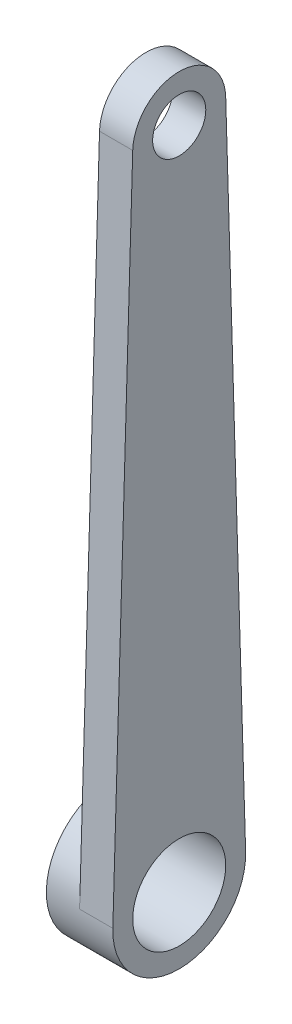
from build123d import *

# Parameters (mm, degrees)
SKETCH1_R           = 10
SKETCH1_R_2         = 17.5
BOSS_EXTRUDE1_DEPTH = 12.5
BOSS_EXTRUDE5_START = -12.5
SKETCH1_6_R         = 17.5
BOSS_EXTRUDE5_DEPTH = 12.5


with BuildPart() as part:
    # Sketch1 → Boss-Extrude1 (new body)
    with BuildSketch(Plane(origin=(0, 0, 0), x_dir=(0, 0, -1), z_dir=(1, 0, 0))):
        with BuildLine():
            Line((-17.492123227, 0.525), (-24.988747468, -249.25))
            ThreePointArc((-24.988747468, -249.25), (0, -275), (24.988747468, -249.25))
            Line((24.988747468, -249.25), (17.492123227, 0.525))
            ThreePointArc((17.492123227, 0.525), (0, 17.5), (-17.492123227, 0.525))
        make_face()
        Circle(SKETCH1_R, mode=Mode.SUBTRACT)
        with Locations((0, -250)):
            Circle(SKETCH1_R_2, mode=Mode.SUBTRACT)
    extrude(amount=BOSS_EXTRUDE1_DEPTH)

    # Sketch1_6 → Boss-Extrude5 (add)
    with BuildSketch(Plane(origin=(0, 0, 0), x_dir=(0, 0, -1), z_dir=(1, 0, 0)).offset(BOSS_EXTRUDE5_START)):
        with BuildLine():
            ThreePointArc((24.988747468, -249.25), (0, -225), (-24.988747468, -249.25))
            ThreePointArc((-24.988747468, -249.25), (0, -275), (24.988747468, -249.25))
        make_face()
        with Locations((0, -250)):
            Circle(SKETCH1_6_R, mode=Mode.SUBTRACT)
    extrude(amount=BOSS_EXTRUDE5_DEPTH)


solid = part.part
